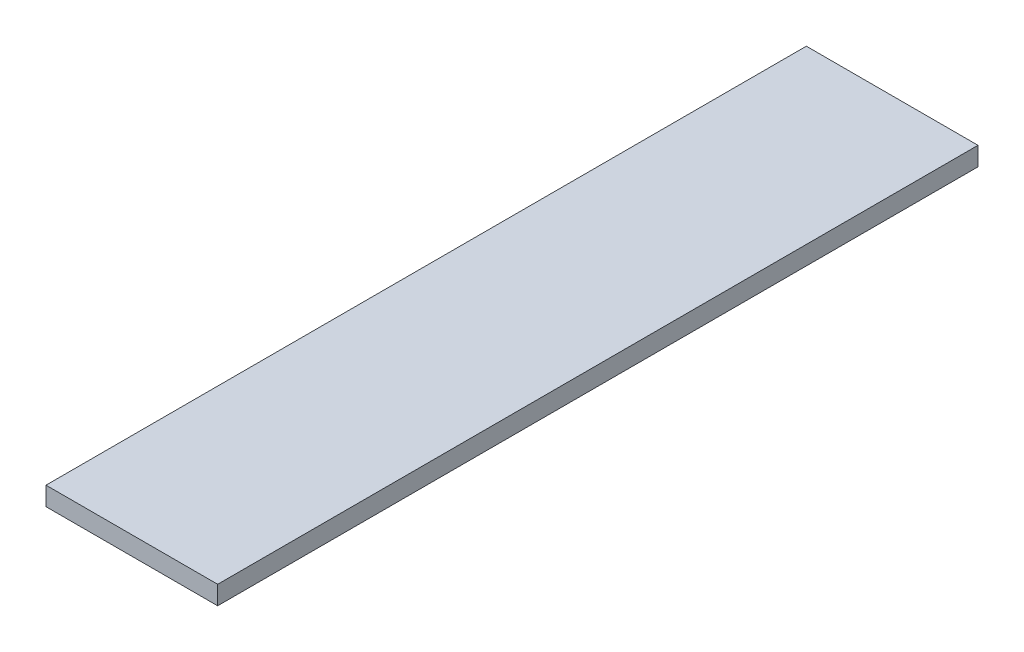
from build123d import *

# Parameters (mm, degrees)
SKETCH1_W           = 1168.4
SKETCH1_H           = 5175.25
BOSS_EXTRUDE1_DEPTH = 127


with BuildPart() as part:
    # Sketch1 → Boss-Extrude1 (new body)
    with BuildSketch(Plane(origin=(0, 0, 0), x_dir=(1, 0, 0), z_dir=(0, 1, 0))):
        Rectangle(SKETCH1_W, SKETCH1_H)
    extrude(amount=BOSS_EXTRUDE1_DEPTH)


solid = part.part
